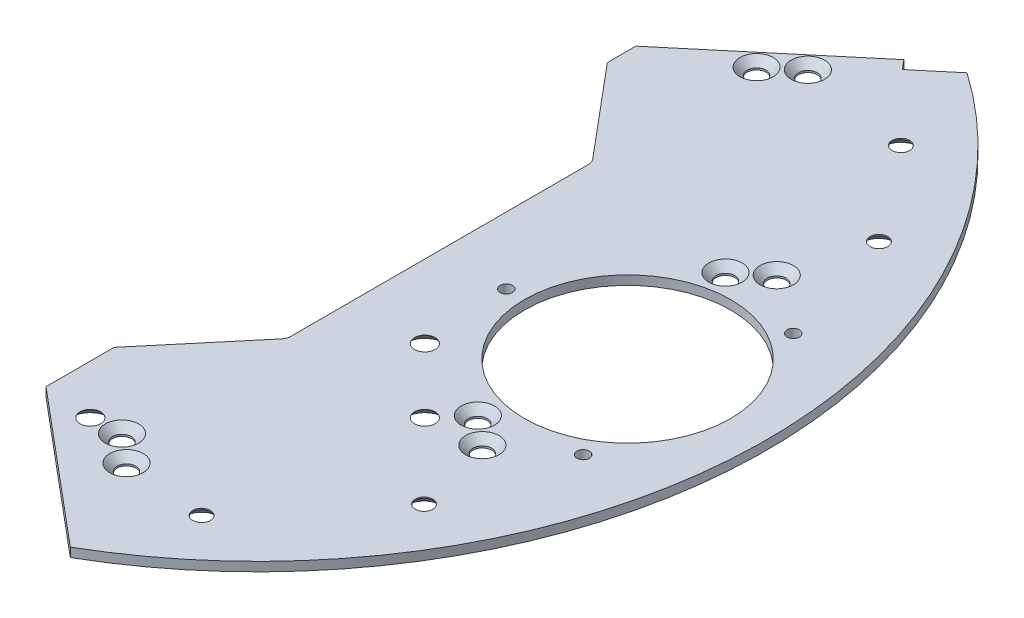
from build123d import *

# Parameters (mm, degrees)
RESSALTO_EXTRUS_O1_DEPTH                           = 1.5
ESBO_O2_R                                          = 17
CORTE_EXTRUS_O1_DEPTH                              = 122.865704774
FURO_ROSCADO_DE_M2_51_D                            = 2.05
CORTE_EXTRUS_O2_DEPTH                              = 2.5
ESCAREADO_PARA_PARAFUSO_COM_CABE_A_E_2_COUNT       = 2
ESCAREADO_PARA_PARAFUSO_COM_CABE_A_E_2_PITCH       = 6
ESCAREADO_PARA_PARAFUSO_COM_CABE_A_E_3_COUNT       = 2
ESCAREADO_PARA_PARAFUSO_COM_CABE_A_E_3_PITCH       = 41.65
ESCAREADO_PARA_PARAFUSO_COM_CABE_A_E_4_COUNT       = 2
ESCAREADO_PARA_PARAFUSO_COM_CABE_A_E_4_PITCH       = 42.07995366
ESCAREADO_PARA_PARAFUSO_COM_CABE_A_E_5_A_COUNT     = 2
ESCAREADO_PARA_PARAFUSO_COM_CABE_A_E_5_A_PITCH     = 6
ESCAREADO_PARA_PARAFUSO_COM_CABE_A_E_6_COUNT       = 2
ESCAREADO_PARA_PARAFUSO_COM_CABE_A_E_6_PITCH       = 41.65
ESCAREADO_PARA_PARAFUSO_COM_CABE_A_E_7_COUNT       = 2
ESCAREADO_PARA_PARAFUSO_COM_CABE_A_E_7_PITCH       = 42.07995366
ESCAREADO_PARA_PARAFUSO_COM_CABE_A_E_8_D           = 2.9
ESCAREADO_PARA_PARAFUSO_COM_CABE_A_E_8_DEPTH       = 7.25
ESCAREADO_PARA_PARAFUSO_COM_CABE_A_E_8_CSINK_D     = 5.5
ESCAREADO_PARA_PARAFUSO_COM_CABE_A_E_8_CSINK_ANGLE = 90
ESCAREADO_PARA_PARAFUSO_COM_CABE_A_E_8_TIP         = 0.871247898
ESCAREADO_PARA_PARAFUSO_COM_CABE_A_E_9_D           = 3.4
ESCAREADO_PARA_PARAFUSO_COM_CABE_A_E_9_DEPTH       = 5
ESCAREADO_PARA_PARAFUSO_COM_CABE_A_E_9_CSINK_D     = 6.3
ESCAREADO_PARA_PARAFUSO_COM_CABE_A_E_9_CSINK_ANGLE = 90
ESCAREADO_PARA_PARAFUSO_COM_CABE_A_E_9_TIP         = 1.021463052
CORTE_EXTRUS_O3_DEPTH                              = 122.865704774
CORTE_EXTRUS_O4_DEPTH                              = 122.865704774
CORTE_EXTRUS_O5_DEPTH                              = 115.773877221
CORTE_EXTRUS_O6_DEPTH                              = 112.164853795


with BuildPart() as part:
    # Esbo_o1 → Ressalto-extrus_o1 (new body)
    with BuildSketch(Plane(origin=(0, 0, 0), x_dir=(1, 0, 0), z_dir=(0, 1, 0))):
        with BuildLine():
            Line((17, -85.322916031), (17, 85.322916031))
            ThreePointArc((17, 85.322916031), (87, 0), (17, -85.322916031))
        make_face()
    extrude(amount=RESSALTO_EXTRUS_O1_DEPTH)

    # Esbo_o2 → Corte-extrus_o1 (cut, through all)
    with BuildSketch(Plane(origin=(0, 1.5, 0), x_dir=(1, 0, 0), z_dir=(0, 1, 0))):
        with Locations(Location((61, 0, 0), (0, 0, 270))):
            Circle(ESBO_O2_R)
    extrude(amount=-CORTE_EXTRUS_O1_DEPTH, mode=Mode.SUBTRACT)

    # Furo roscado de M2.51 (through all)
    with Locations(Plane(origin=(71, 1.5, 17.320508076), x_dir=(0, 0, 1), z_dir=(0, 1, 0))):
        with Locations((0, 0), (-17.320508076, -30), (-34.641016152, 0)):
            Hole(FURO_ROSCADO_DE_M2_51_D / 2)

    # Esbo_o4 → Corte-extrus_o2 (cut)
    with BuildSketch(Plane(origin=(0, 1.5, 0), x_dir=(1, 0, 0), z_dir=(0, 1, 0))):
        with BuildLine():
            Line((30, 0), (30, 24.445048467))
            ThreePointArc((30, 24.445048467), (29.879385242, 25.129088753), (29.532088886, 25.730623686))
            Line((29.532088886, 25.730623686), (17, 40.665785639))
            Line((17, 40.665785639), (17, -40.665785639))
            Line((17, -40.665785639), (29.532088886, -25.730623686))
            ThreePointArc((29.532088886, -25.730623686), (29.879385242, -25.129088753), (30, -24.445048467))
            Line((30, -24.445048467), (30, 0))
        make_face()
    extrude(amount=-CORTE_EXTRUS_O2_DEPTH, mode=Mode.SUBTRACT)

    # Esbo_o6 → Escareado para parafuso com cabe_a escar (revolve, cut)
    with BuildSketch(Plane(origin=(34.552273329, 1.5, -56.177906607), x_dir=(0, 0, 1), z_dir=(1, 0, 0))):
        Polygon((0, 0), (0, 1.5), (1.55, 1.5), (1.55, 1.2), (2.75, 0), align=None)
    escareado_para_parafuso_com_cabe_a_escar = revolve(axis=Axis((34.552273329, 7.85, -56.177906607), (0, -1, 0)), mode=Mode.SUBTRACT)

    # Escareado para parafuso com cabe_a e 2: Escareado para parafuso com cabe_a escar ×2
    with Locations(*[Vector(-0.7660444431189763, 0, 0.6427876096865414) * (i * ESCAREADO_PARA_PARAFUSO_COM_CABE_A_E_2_PITCH) for i in range(1, ESCAREADO_PARA_PARAFUSO_COM_CABE_A_E_2_COUNT)]):
        add(escareado_para_parafuso_com_cabe_a_escar, mode=Mode.SUBTRACT)

    # Escareado para parafuso com cabe_a e 3: Escareado para parafuso com cabe_a escar ×2
    with Locations(*[Vector(0.6427876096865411, 0, 0.7660444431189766) * (i * ESCAREADO_PARA_PARAFUSO_COM_CABE_A_E_3_PITCH) for i in range(1, ESCAREADO_PARA_PARAFUSO_COM_CABE_A_E_3_COUNT)]):
        add(escareado_para_parafuso_com_cabe_a_escar, mode=Mode.SUBTRACT)

    # Escareado para parafuso com cabe_a e 4: Escareado para parafuso com cabe_a escar ×2
    with Locations(*[Vector(0.5269929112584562, 0, 0.8498696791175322) * (i * ESCAREADO_PARA_PARAFUSO_COM_CABE_A_E_4_PITCH) for i in range(1, ESCAREADO_PARA_PARAFUSO_COM_CABE_A_E_4_COUNT)]):
        add(escareado_para_parafuso_com_cabe_a_escar, mode=Mode.SUBTRACT)

    # Esbo_o7 → Escareado para parafuso com cabe_a e 5 (revolve, cut)
    with BuildSketch(Plane(origin=(56.728110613, 1.5, 20.415429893), x_dir=(0, 0, 1), z_dir=(1, 0, 0))):
        Polygon((0, 0), (0, 1.5), (1.55, 1.5), (1.55, 1.2), (2.75, 0), align=None)
    escareado_para_parafuso_com_cabe_a_e_5 = revolve(axis=Axis((56.728110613, 7.85, 20.415429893), (0, -1, 0)), mode=Mode.SUBTRACT)

    # Escareado para parafuso com cabe_a e 5 a: Escareado para parafuso com cabe_a e 5 ×2
    with Locations(*[Vector(0.7660444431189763, 0, 0.6427876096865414) * (i * ESCAREADO_PARA_PARAFUSO_COM_CABE_A_E_5_A_PITCH) for i in range(1, ESCAREADO_PARA_PARAFUSO_COM_CABE_A_E_5_A_COUNT)]):
        add(escareado_para_parafuso_com_cabe_a_e_5, mode=Mode.SUBTRACT)

    # Escareado para parafuso com cabe_a e 6: Escareado para parafuso com cabe_a e 5 ×2
    with Locations(*[Vector(-0.64278760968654, 0, 0.7660444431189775) * (i * ESCAREADO_PARA_PARAFUSO_COM_CABE_A_E_6_PITCH) for i in range(1, ESCAREADO_PARA_PARAFUSO_COM_CABE_A_E_6_COUNT)]):
        add(escareado_para_parafuso_com_cabe_a_e_5, mode=Mode.SUBTRACT)

    # Escareado para parafuso com cabe_a e 7: Escareado para parafuso com cabe_a e 5 ×2
    with Locations(*[Vector(-0.5269929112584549, 0, 0.8498696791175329) * (i * ESCAREADO_PARA_PARAFUSO_COM_CABE_A_E_7_PITCH) for i in range(1, ESCAREADO_PARA_PARAFUSO_COM_CABE_A_E_7_COUNT)]):
        add(escareado_para_parafuso_com_cabe_a_e_5, mode=Mode.SUBTRACT)

    # Escareado para parafuso com cabe_a e 8
    with Locations(Plane(origin=(48.209070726, 0, 57.453333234), x_dir=(0, 0, -1), z_dir=(0, -1, 0))):
        with Locations((0, 0), (19.953333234, 16.742834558), (94.953333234, 16.742834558), (110.486341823, 4.823937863)):
            CounterSinkHole(ESCAREADO_PARA_PARAFUSO_COM_CABE_A_E_8_D / 2, ESCAREADO_PARA_PARAFUSO_COM_CABE_A_E_8_CSINK_D / 2, depth=ESCAREADO_PARA_PARAFUSO_COM_CABE_A_E_8_DEPTH, counter_sink_angle=ESCAREADO_PARA_PARAFUSO_COM_CABE_A_E_8_CSINK_ANGLE)
            with Locations((0, 0, -(ESCAREADO_PARA_PARAFUSO_COM_CABE_A_E_8_DEPTH + ESCAREADO_PARA_PARAFUSO_COM_CABE_A_E_8_TIP / 2))):  # 118° drill point
                Cone(0, ESCAREADO_PARA_PARAFUSO_COM_CABE_A_E_8_D / 2, ESCAREADO_PARA_PARAFUSO_COM_CABE_A_E_8_TIP, mode=Mode.SUBTRACT)

    # Escareado para parafuso com cabe_a e 9
    with Locations(Plane(origin=(42.072853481, 0, 14.495689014), x_dir=(0, 0, -1), z_dir=(0, -1, 0))):
        with Locations((0, 0), (-10.606601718, 10.606601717), (-38.183766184, -16.970562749)):
            CounterSinkHole(ESCAREADO_PARA_PARAFUSO_COM_CABE_A_E_9_D / 2, ESCAREADO_PARA_PARAFUSO_COM_CABE_A_E_9_CSINK_D / 2, depth=ESCAREADO_PARA_PARAFUSO_COM_CABE_A_E_9_DEPTH, counter_sink_angle=ESCAREADO_PARA_PARAFUSO_COM_CABE_A_E_9_CSINK_ANGLE)
            with Locations((0, 0, -(ESCAREADO_PARA_PARAFUSO_COM_CABE_A_E_9_DEPTH + ESCAREADO_PARA_PARAFUSO_COM_CABE_A_E_9_TIP / 2))):  # 118° drill point
                Cone(0, ESCAREADO_PARA_PARAFUSO_COM_CABE_A_E_9_D / 2, ESCAREADO_PARA_PARAFUSO_COM_CABE_A_E_9_TIP, mode=Mode.SUBTRACT)

    # Esbo_o17 → Corte-extrus_o3 (cut, through all)
    with BuildSketch(Plane.XZ):
        Polygon((28.027643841, -54.619314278), (17, -45.366022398), (17, -85.322916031), (48.78373029, -85.322916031), (48.78373029, -72.035738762), align=None)
    extrude(amount=-CORTE_EXTRUS_O3_DEPTH, mode=Mode.SUBTRACT)

    # Esbo_o18 → Corte-extrus_o4 (cut, through all)
    with BuildSketch(Plane(origin=(0, 1.5, 0), x_dir=(1, 0, 0), z_dir=(0, 1, 0))):
        Polygon((24.813705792, -58.449536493), (17, -51.893058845), (17, -85.322916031), (56.840152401, -85.322916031), align=None)
    extrude(amount=-CORTE_EXTRUS_O4_DEPTH, mode=Mode.SUBTRACT)

    # Esbo_o19 → Corte-extrus_o5 (cut, through all)
    with BuildSketch(Plane(origin=(0, 1.5, 0), x_dir=(1, 0, 0), z_dir=(0, 1, 0))):
        with BuildLine():
            Line((48.78373029, 72.035738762), (46.390783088, 70.027817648))
            ThreePointArc((46.390783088, 70.027817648), (83.958731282, -2.632763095), (41.91211377, -72.796804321))
            Line((41.91211377, -72.796804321), (44.35320854, -74.845126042))
            ThreePointArc((44.35320854, -74.845126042), (86.960447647, -2.623079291), (48.78373029, 72.035738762))
        make_face()
    extrude(amount=-CORTE_EXTRUS_O5_DEPTH, mode=Mode.SUBTRACT)

    # Esbo_o20 → Corte-extrus_o6 (cut, through all)
    with BuildSketch(Plane(origin=(0, 1.5, 0), x_dir=(1, 0, 0), z_dir=(0, 1, 0))):
        Polygon((41.028471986, 65.52830438), (42.314047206, 63.996215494), (48.108978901, 68.858740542), (46.823403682, 70.390829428), align=None)
    extrude(amount=-CORTE_EXTRUS_O6_DEPTH, mode=Mode.SUBTRACT)


solid = part.part
